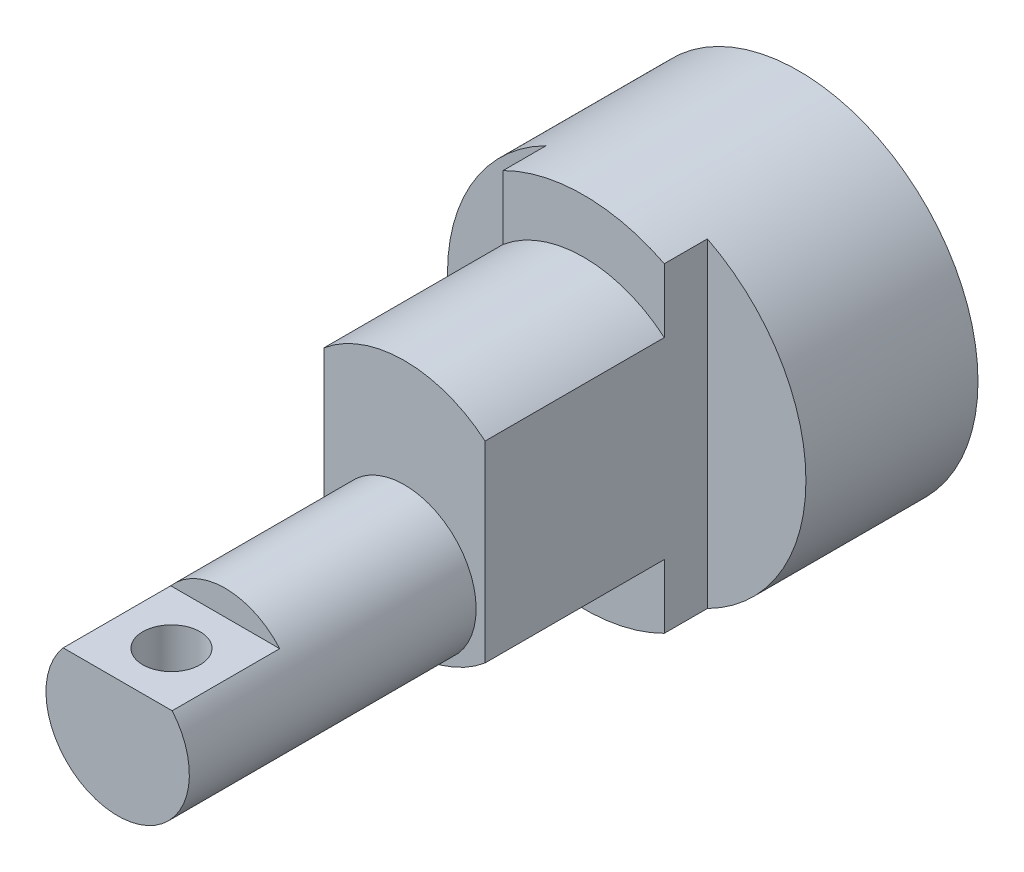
ISO-10303-21;
HEADER;
FILE_DESCRIPTION(('STEP AP214'),'2;1');
FILE_NAME('part.step','',(''),(''),'','','');
FILE_SCHEMA(('AUTOMOTIVE_DESIGN { 1 0 10303 214 1 1 1 1 }'));
ENDSEC;
DATA;
#1=APPLICATION_CONTEXT('core data for automotive mechanical design processes');
#2=APPLICATION_PROTOCOL_DEFINITION('international standard','automotive_design',2000,#1);
#3=PRODUCT_CONTEXT('',#1,'mechanical');
#4=PRODUCT('Part','Part','',(#3));
#5=PRODUCT_RELATED_PRODUCT_CATEGORY('part','',(#4));
#6=PRODUCT_DEFINITION_FORMATION('','',#4);
#7=PRODUCT_DEFINITION_CONTEXT('part definition',#1,'design');
#8=PRODUCT_DEFINITION('design','',#6,#7);
#9=PRODUCT_DEFINITION_SHAPE('','',#8);
#10=(LENGTH_UNIT() NAMED_UNIT(*) SI_UNIT(.MILLI.,.METRE.));
#11=(NAMED_UNIT(*) PLANE_ANGLE_UNIT() SI_UNIT($,.RADIAN.));
#12=(NAMED_UNIT(*) SI_UNIT($,.STERADIAN.) SOLID_ANGLE_UNIT());
#13=UNCERTAINTY_MEASURE_WITH_UNIT(LENGTH_MEASURE(1.E-05),#10,'distance_accuracy_value','');
#14=(GEOMETRIC_REPRESENTATION_CONTEXT(3) GLOBAL_UNCERTAINTY_ASSIGNED_CONTEXT((#13)) GLOBAL_UNIT_ASSIGNED_CONTEXT((#10,
#11,#12)) REPRESENTATION_CONTEXT('',''));
#15=CARTESIAN_POINT('',(0.,0.,0.));
#16=DIRECTION('',(0.,0.,1.));
#17=DIRECTION('',(1.,0.,0.));
#18=AXIS2_PLACEMENT_3D('',#15,#16,#17);
#19=CARTESIAN_POINT('',(0.,0.,60.));
#20=DIRECTION('',(0.,0.,1.));
#21=DIRECTION('',(1.,0.,0.));
#22=AXIS2_PLACEMENT_3D('',#19,#20,#21);
#23=PLANE('',#22);
#24=CARTESIAN_POINT('',(0.,0.,60.));
#25=DIRECTION('',(0.,0.,1.));
#26=DIRECTION('',(1.,0.,0.));
#27=AXIS2_PLACEMENT_3D('',#24,#25,#26);
#28=CIRCLE('',#27,50.);
#29=CARTESIAN_POINT('',(22.5,44.6514277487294,60.));
#30=VERTEX_POINT('',#29);
#31=CARTESIAN_POINT('',(-22.5,44.6514277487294,60.));
#32=VERTEX_POINT('',#31);
#33=EDGE_CURVE('E219',#30,#32,#28,.T.);
#34=ORIENTED_EDGE('',*,*,#33,.T.);
#35=DIRECTION('',(0.,-1.,0.));
#36=VECTOR('',#35,1.);
#37=CARTESIAN_POINT('',(-22.5,0.,60.));
#38=LINE('',#37,#36);
#39=CARTESIAN_POINT('',(-22.5,26.809513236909,60.));
#40=VERTEX_POINT('',#39);
#41=EDGE_CURVE('E134',#32,#40,#38,.T.);
#42=ORIENTED_EDGE('',*,*,#41,.T.);
#43=CARTESIAN_POINT('',(0.,0.,60.));
#44=DIRECTION('',(0.,0.,1.));
#45=DIRECTION('',(1.,0.,0.));
#46=AXIS2_PLACEMENT_3D('',#43,#44,#45);
#47=CIRCLE('',#46,35.);
#48=CARTESIAN_POINT('',(22.5,26.809513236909,60.));
#49=VERTEX_POINT('',#48);
#50=EDGE_CURVE('E240',#49,#40,#47,.T.);
#51=ORIENTED_EDGE('',*,*,#50,.F.);
#52=DIRECTION('',(0.,1.,0.));
#53=VECTOR('',#52,1.);
#54=CARTESIAN_POINT('',(22.5,0.,60.));
#55=LINE('',#54,#53);
#56=EDGE_CURVE('E150',#49,#30,#55,.T.);
#57=ORIENTED_EDGE('',*,*,#56,.T.);
#58=EDGE_LOOP('',(#34,#42,#51,#57));
#59=FACE_BOUND('',#58,.T.);
#60=ADVANCED_FACE('F31',(#59),#23,.T.);
#61=CARTESIAN_POINT('',(-22.5,-26.809513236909,60.));
#62=VERTEX_POINT('',#61);
#63=CARTESIAN_POINT('',(22.5,-26.809513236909,60.));
#64=VERTEX_POINT('',#63);
#65=EDGE_CURVE('E244',#62,#64,#47,.T.);
#66=ORIENTED_EDGE('',*,*,#65,.F.);
#67=CARTESIAN_POINT('',(-22.5,-44.6514277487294,60.));
#68=VERTEX_POINT('',#67);
#69=EDGE_CURVE('E132',#62,#68,#38,.T.);
#70=ORIENTED_EDGE('',*,*,#69,.T.);
#71=CARTESIAN_POINT('',(22.5,-44.6514277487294,60.));
#72=VERTEX_POINT('',#71);
#73=EDGE_CURVE('E125',#68,#72,#28,.T.);
#74=ORIENTED_EDGE('',*,*,#73,.T.);
#75=EDGE_CURVE('E153',#72,#64,#55,.T.);
#76=ORIENTED_EDGE('',*,*,#75,.T.);
#77=EDGE_LOOP('',(#66,#70,#74,#76));
#78=FACE_BOUND('',#77,.T.);
#79=ADVANCED_FACE('F195',(#78),#23,.T.);
#80=CARTESIAN_POINT('',(0.,0.,60.));
#81=DIRECTION('',(0.,0.,-1.));
#82=DIRECTION('',(-1.,0.,0.));
#83=AXIS2_PLACEMENT_3D('',#80,#81,#82);
#84=CYLINDRICAL_SURFACE('',#83,50.);
#85=CARTESIAN_POINT('',(0.,0.,0.));
#86=DIRECTION('',(0.,0.,1.));
#87=DIRECTION('',(1.,0.,0.));
#88=AXIS2_PLACEMENT_3D('',#85,#86,#87);
#89=CIRCLE('',#88,50.);
#90=CARTESIAN_POINT('',(50.,0.,0.));
#91=VERTEX_POINT('',#90);
#92=EDGE_CURVE('E215',#91,#91,#89,.T.);
#93=ORIENTED_EDGE('',*,*,#92,.T.);
#94=EDGE_LOOP('',(#93));
#95=FACE_BOUND('',#94,.T.);
#96=DIRECTION('',(0.,0.,-1.));
#97=VECTOR('',#96,1.);
#98=CARTESIAN_POINT('',(-22.5,44.6514277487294,190.));
#99=LINE('',#98,#97);
#100=CARTESIAN_POINT('',(-22.5,44.6514277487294,48.));
#101=VERTEX_POINT('',#100);
#102=EDGE_CURVE('E115',#32,#101,#99,.T.);
#103=ORIENTED_EDGE('',*,*,#102,.F.);
#104=ORIENTED_EDGE('',*,*,#33,.F.);
#105=DIRECTION('',(0.,0.,-1.));
#106=VECTOR('',#105,1.);
#107=CARTESIAN_POINT('',(22.5,44.6514277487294,190.));
#108=LINE('',#107,#106);
#109=CARTESIAN_POINT('',(22.5,44.6514277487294,48.));
#110=VERTEX_POINT('',#109);
#111=EDGE_CURVE('E143',#30,#110,#108,.T.);
#112=ORIENTED_EDGE('',*,*,#111,.T.);
#113=CARTESIAN_POINT('',(0.,0.,48.));
#114=DIRECTION('',(0.,0.,1.));
#115=DIRECTION('',(1.,0.,0.));
#116=AXIS2_PLACEMENT_3D('',#113,#114,#115);
#117=CIRCLE('',#116,50.);
#118=CARTESIAN_POINT('',(22.5,-44.6514277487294,48.));
#119=VERTEX_POINT('',#118);
#120=EDGE_CURVE('E135',#119,#110,#117,.T.);
#121=ORIENTED_EDGE('',*,*,#120,.F.);
#122=DIRECTION('',(0.,0.,-1.));
#123=VECTOR('',#122,1.);
#124=CARTESIAN_POINT('',(22.5,-44.6514277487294,190.));
#125=LINE('',#124,#123);
#126=EDGE_CURVE('E141',#72,#119,#125,.T.);
#127=ORIENTED_EDGE('',*,*,#126,.F.);
#128=ORIENTED_EDGE('',*,*,#73,.F.);
#129=DIRECTION('',(0.,0.,-1.));
#130=VECTOR('',#129,1.);
#131=CARTESIAN_POINT('',(-22.5,-44.6514277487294,190.));
#132=LINE('',#131,#130);
#133=CARTESIAN_POINT('',(-22.5,-44.6514277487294,48.));
#134=VERTEX_POINT('',#133);
#135=EDGE_CURVE('E112',#68,#134,#132,.T.);
#136=ORIENTED_EDGE('',*,*,#135,.T.);
#137=CARTESIAN_POINT('',(0.,0.,48.));
#138=DIRECTION('',(0.,0.,1.));
#139=DIRECTION('',(1.,0.,0.));
#140=AXIS2_PLACEMENT_3D('',#137,#138,#139);
#141=CIRCLE('',#140,50.);
#142=EDGE_CURVE('E118',#101,#134,#141,.T.);
#143=ORIENTED_EDGE('',*,*,#142,.F.);
#144=EDGE_LOOP('',(#103,#104,#112,#121,#127,#128,#136,#143));
#145=FACE_BOUND('',#144,.T.);
#146=ADVANCED_FACE('F33',(#95,#145),#84,.T.);
#147=CARTESIAN_POINT('',(0.,0.,110.));
#148=DIRECTION('',(0.,0.,-1.));
#149=DIRECTION('',(-1.,0.,0.));
#150=AXIS2_PLACEMENT_3D('',#147,#148,#149);
#151=CYLINDRICAL_SURFACE('',#150,35.);
#152=DIRECTION('',(0.,0.,-1.));
#153=VECTOR('',#152,1.);
#154=CARTESIAN_POINT('',(-22.5,26.809513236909,110.));
#155=LINE('',#154,#153);
#156=CARTESIAN_POINT('',(-22.5,26.809513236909,110.));
#157=VERTEX_POINT('',#156);
#158=EDGE_CURVE('E127',#157,#40,#155,.T.);
#159=ORIENTED_EDGE('',*,*,#158,.F.);
#160=CARTESIAN_POINT('',(0.,0.,110.));
#161=DIRECTION('',(0.,0.,1.));
#162=DIRECTION('',(1.,0.,0.));
#163=AXIS2_PLACEMENT_3D('',#160,#161,#162);
#164=CIRCLE('',#163,35.);
#165=CARTESIAN_POINT('',(22.5,26.809513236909,110.));
#166=VERTEX_POINT('',#165);
#167=EDGE_CURVE('E222',#166,#157,#164,.T.);
#168=ORIENTED_EDGE('',*,*,#167,.F.);
#169=DIRECTION('',(0.,0.,-1.));
#170=VECTOR('',#169,1.);
#171=CARTESIAN_POINT('',(22.5,26.809513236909,110.));
#172=LINE('',#171,#170);
#173=EDGE_CURVE('E53',#49,#166,#172,.F.);
#174=ORIENTED_EDGE('',*,*,#173,.F.);
#175=ORIENTED_EDGE('',*,*,#50,.T.);
#176=EDGE_LOOP('',(#159,#168,#174,#175));
#177=FACE_BOUND('',#176,.T.);
#178=ADVANCED_FACE('F204',(#177),#151,.T.);
#179=DIRECTION('',(0.,0.,-1.));
#180=VECTOR('',#179,1.);
#181=CARTESIAN_POINT('',(-22.5,-26.809513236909,110.));
#182=LINE('',#181,#180);
#183=CARTESIAN_POINT('',(-22.5,-26.809513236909,110.));
#184=VERTEX_POINT('',#183);
#185=EDGE_CURVE('E46',#62,#184,#182,.F.);
#186=ORIENTED_EDGE('',*,*,#185,.F.);
#187=ORIENTED_EDGE('',*,*,#65,.T.);
#188=DIRECTION('',(0.,0.,-1.));
#189=VECTOR('',#188,1.);
#190=CARTESIAN_POINT('',(22.5,-26.809513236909,110.));
#191=LINE('',#190,#189);
#192=CARTESIAN_POINT('',(22.5,-26.809513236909,110.));
#193=VERTEX_POINT('',#192);
#194=EDGE_CURVE('E147',#193,#64,#191,.T.);
#195=ORIENTED_EDGE('',*,*,#194,.F.);
#196=CARTESIAN_POINT('',(0.,-35.,110.));
#197=VERTEX_POINT('',#196);
#198=EDGE_CURVE('E217',#197,#193,#164,.T.);
#199=ORIENTED_EDGE('',*,*,#198,.F.);
#200=EDGE_CURVE('E224',#184,#197,#164,.T.);
#201=ORIENTED_EDGE('',*,*,#200,.F.);
#202=EDGE_LOOP('',(#186,#187,#195,#199,#201));
#203=FACE_BOUND('',#202,.T.);
#204=ADVANCED_FACE('F211',(#203),#151,.T.);
#205=CARTESIAN_POINT('',(0.,0.,110.));
#206=DIRECTION('',(0.,0.,1.));
#207=DIRECTION('',(1.,0.,0.));
#208=AXIS2_PLACEMENT_3D('',#205,#206,#207);
#209=PLANE('',#208);
#210=ORIENTED_EDGE('',*,*,#167,.T.);
#211=DIRECTION('',(0.,-1.,0.));
#212=VECTOR('',#211,1.);
#213=CARTESIAN_POINT('',(-22.5,0.,110.));
#214=LINE('',#213,#212);
#215=EDGE_CURVE('E11',#157,#184,#214,.T.);
#216=ORIENTED_EDGE('',*,*,#215,.T.);
#217=ORIENTED_EDGE('',*,*,#200,.T.);
#218=CARTESIAN_POINT('',(0.,-15.,110.));
#219=DIRECTION('',(0.,0.,1.));
#220=DIRECTION('',(1.,0.,0.));
#221=AXIS2_PLACEMENT_3D('',#218,#219,#220);
#222=CIRCLE('',#221,20.);
#223=EDGE_CURVE('E242',#197,#197,#222,.T.);
#224=ORIENTED_EDGE('',*,*,#223,.F.);
#225=ORIENTED_EDGE('',*,*,#198,.T.);
#226=DIRECTION('',(0.,1.,0.));
#227=VECTOR('',#226,1.);
#228=CARTESIAN_POINT('',(22.5,0.,110.));
#229=LINE('',#228,#227);
#230=EDGE_CURVE('E39',#193,#166,#229,.T.);
#231=ORIENTED_EDGE('',*,*,#230,.T.);
#232=EDGE_LOOP('',(#210,#216,#217,#224,#225,#231));
#233=FACE_BOUND('',#232,.T.);
#234=ADVANCED_FACE('F206',(#233),#209,.T.);
#235=CARTESIAN_POINT('',(0.,0.,0.));
#236=DIRECTION('',(0.,0.,1.));
#237=DIRECTION('',(1.,0.,0.));
#238=AXIS2_PLACEMENT_3D('',#235,#236,#237);
#239=PLANE('',#238);
#240=ORIENTED_EDGE('',*,*,#92,.F.);
#241=EDGE_LOOP('',(#240));
#242=FACE_BOUND('',#241,.T.);
#243=ADVANCED_FACE('F191',(#242),#239,.F.);
#244=CARTESIAN_POINT('',(0.,-15.,190.));
#245=DIRECTION('',(0.,0.,-1.));
#246=DIRECTION('',(-1.,0.,0.));
#247=AXIS2_PLACEMENT_3D('',#244,#245,#246);
#248=CYLINDRICAL_SURFACE('',#247,20.);
#249=CARTESIAN_POINT('',(0.,-35.,183.));
#250=CARTESIAN_POINT('',(0.215084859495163,-34.9999990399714,182.999998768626));
#251=CARTESIAN_POINT('',(0.430252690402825,-34.9965207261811,182.991314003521));
#252=CARTESIAN_POINT('',(0.859066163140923,-34.9826945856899,182.956653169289));
#253=CARTESIAN_POINT('',(1.07271069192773,-34.9723421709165,182.930665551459));
#254=CARTESIAN_POINT('',(1.49730331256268,-34.9450103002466,182.861580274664));
#255=CARTESIAN_POINT('',(1.70824399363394,-34.928015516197,182.818443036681));
#256=CARTESIAN_POINT('',(2.12541850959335,-34.8878485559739,182.715488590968));
#257=CARTESIAN_POINT('',(2.3316520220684,-34.864675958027,182.655670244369));
#258=CARTESIAN_POINT('',(2.7373286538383,-34.8128420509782,182.520147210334));
#259=CARTESIAN_POINT('',(2.93679233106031,-34.7841995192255,182.444496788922));
#260=CARTESIAN_POINT('',(3.32841850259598,-34.722092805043,182.277837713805));
#261=CARTESIAN_POINT('',(3.5205807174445,-34.6886284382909,182.186828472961));
#262=CARTESIAN_POINT('',(3.89636668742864,-34.6177182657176,181.990226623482));
#263=CARTESIAN_POINT('',(4.0799955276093,-34.5802748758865,181.884642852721));
#264=CARTESIAN_POINT('',(4.43790440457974,-34.5022708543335,181.659558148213));
#265=CARTESIAN_POINT('',(4.61218102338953,-34.4617090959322,181.540052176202));
#266=CARTESIAN_POINT('',(4.95765252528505,-34.3766526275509,181.282520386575));
#267=CARTESIAN_POINT('',(5.12839697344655,-34.3320639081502,181.143921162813));
#268=CARTESIAN_POINT('',(5.45773322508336,-34.2416816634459,180.853322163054));
#269=CARTESIAN_POINT('',(5.616324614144,-34.1958880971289,180.701321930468));
#270=CARTESIAN_POINT('',(5.92057321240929,-34.1042423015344,180.384704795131));
#271=CARTESIAN_POINT('',(6.06622210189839,-34.0583900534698,180.220079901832));
#272=CARTESIAN_POINT('',(6.34357963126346,-33.9678748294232,179.87926764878));
#273=CARTESIAN_POINT('',(6.4752929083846,-33.9232114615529,179.703084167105));
#274=CARTESIAN_POINT('',(6.7296133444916,-33.8343107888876,179.331878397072));
#275=CARTESIAN_POINT('',(6.85154351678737,-33.7901832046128,179.13636506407));
#276=CARTESIAN_POINT('',(7.07835580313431,-33.705921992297,178.73496931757));
#277=CARTESIAN_POINT('',(7.18324492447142,-33.6657867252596,178.529091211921));
#278=CARTESIAN_POINT('',(7.37511081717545,-33.5908137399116,178.108248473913));
#279=CARTESIAN_POINT('',(7.4620902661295,-33.5559752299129,177.893285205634));
#280=CARTESIAN_POINT('',(7.61728962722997,-33.4928075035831,177.455761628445));
#281=CARTESIAN_POINT('',(7.68551081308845,-33.4644778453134,177.233201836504));
#282=CARTESIAN_POINT('',(7.79978805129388,-33.416486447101,176.792419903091));
#283=CARTESIAN_POINT('',(7.84670853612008,-33.3964900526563,176.574458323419));
#284=CARTESIAN_POINT('',(7.92224162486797,-33.3640895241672,176.134824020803));
#285=CARTESIAN_POINT('',(7.95085475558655,-33.3516851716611,175.913151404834));
#286=CARTESIAN_POINT('',(7.98942376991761,-33.3349271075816,175.467978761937));
#287=CARTESIAN_POINT('',(7.99938754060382,-33.3305699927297,175.244479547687));
#288=CARTESIAN_POINT('',(8.00055757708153,-33.3300595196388,174.797427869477));
#289=CARTESIAN_POINT('',(7.99176471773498,-33.3339057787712,174.573875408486));
#290=CARTESIAN_POINT('',(7.95680250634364,-33.3491040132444,174.144155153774));
#291=CARTESIAN_POINT('',(7.93189049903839,-33.3599126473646,173.937864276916));
#292=CARTESIAN_POINT('',(7.86618688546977,-33.3881587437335,173.528215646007));
#293=CARTESIAN_POINT('',(7.82538978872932,-33.4055984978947,173.324858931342));
#294=CARTESIAN_POINT('',(7.72832801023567,-33.4465637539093,172.922560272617));
#295=CARTESIAN_POINT('',(7.67206718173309,-33.4700877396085,172.723617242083));
#296=CARTESIAN_POINT('',(7.54455726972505,-33.5225377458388,172.331249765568));
#297=CARTESIAN_POINT('',(7.4733024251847,-33.5514658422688,172.13782747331));
#298=CARTESIAN_POINT('',(7.31482768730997,-33.6145295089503,171.753881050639));
#299=CARTESIAN_POINT('',(7.22731692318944,-33.648757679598,171.563492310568));
#300=CARTESIAN_POINT('',(7.03795125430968,-33.7210446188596,171.190672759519));
#301=CARTESIAN_POINT('',(6.93609149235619,-33.7591046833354,171.008244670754));
#302=CARTESIAN_POINT('',(6.71872095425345,-33.8380507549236,170.652325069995));
#303=CARTESIAN_POINT('',(6.60320835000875,-33.8789371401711,170.478834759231));
#304=CARTESIAN_POINT('',(6.35923627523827,-33.9625087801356,170.141664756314));
#305=CARTESIAN_POINT('',(6.23077613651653,-34.0051941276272,169.97798557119));
#306=CARTESIAN_POINT('',(5.95116932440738,-34.0946788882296,169.648950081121));
#307=CARTESIAN_POINT('',(5.79903588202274,-34.1415406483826,169.484447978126));
#308=CARTESIAN_POINT('',(5.48150551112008,-34.2348764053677,169.168773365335));
#309=CARTESIAN_POINT('',(5.31611250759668,-34.2813505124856,169.01759693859));
#310=CARTESIAN_POINT('',(4.97286450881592,-34.3727172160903,168.729364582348));
#311=CARTESIAN_POINT('',(4.79500239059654,-34.4176088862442,168.592316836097));
#312=CARTESIAN_POINT('',(4.42799503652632,-34.5045739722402,168.333421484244));
#313=CARTESIAN_POINT('',(4.23885435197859,-34.5466485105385,168.211567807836));
#314=CARTESIAN_POINT('',(3.84640227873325,-34.6276879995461,167.981598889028));
#315=CARTESIAN_POINT('',(3.64288128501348,-34.6665725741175,167.873812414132));
#316=CARTESIAN_POINT('',(3.22662197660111,-34.7391367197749,167.675930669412));
#317=CARTESIAN_POINT('',(3.01388765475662,-34.7728185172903,167.585827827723));
#318=CARTESIAN_POINT('',(2.58066910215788,-34.8340108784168,167.424144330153));
#319=CARTESIAN_POINT('',(2.36018631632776,-34.8615225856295,167.352560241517));
#320=CARTESIAN_POINT('',(1.913130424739,-34.9095569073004,167.228660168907));
#321=CARTESIAN_POINT('',(1.68655774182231,-34.9300800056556,167.176342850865));
#322=CARTESIAN_POINT('',(1.24272594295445,-34.9625193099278,167.094083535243));
#323=CARTESIAN_POINT('',(1.02570985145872,-34.974873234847,167.062999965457));
#324=CARTESIAN_POINT('',(0.589574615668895,-34.9924991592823,167.018744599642));
#325=CARTESIAN_POINT('',(0.370455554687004,-34.9977714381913,167.005572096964));
#326=CARTESIAN_POINT('',(-0.0681278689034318,-35.0010860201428,166.997284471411));
#327=CARTESIAN_POINT('',(-0.287592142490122,-34.9991299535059,167.002165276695));
#328=CARTESIAN_POINT('',(-0.725194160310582,-34.9880462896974,167.02992114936));
#329=CARTESIAN_POINT('',(-0.943331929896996,-34.978918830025,167.052795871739));
#330=CARTESIAN_POINT('',(-1.36679772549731,-34.9543179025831,167.114851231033));
#331=CARTESIAN_POINT('',(-1.57225908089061,-34.9391499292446,167.153248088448));
#332=CARTESIAN_POINT('',(-1.97912323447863,-34.9028842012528,167.245864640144));
#333=CARTESIAN_POINT('',(-2.18052458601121,-34.8817843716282,167.300089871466));
#334=CARTESIAN_POINT('',(-2.57783869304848,-34.834181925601,167.423851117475));
#335=CARTESIAN_POINT('',(-2.7737530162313,-34.8076808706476,167.493382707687));
#336=CARTESIAN_POINT('',(-3.15904550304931,-34.7498961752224,167.647212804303));
#337=CARTESIAN_POINT('',(-3.34842114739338,-34.7186107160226,167.731516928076));
#338=CARTESIAN_POINT('',(-3.72510207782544,-34.6509879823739,167.916991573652));
#339=CARTESIAN_POINT('',(-3.9121720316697,-34.6145266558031,168.018594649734));
#340=CARTESIAN_POINT('',(-4.27717789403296,-34.5381813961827,168.23605894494));
#341=CARTESIAN_POINT('',(-4.45511064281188,-34.4982962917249,168.351925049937));
#342=CARTESIAN_POINT('',(-4.8008662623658,-34.4160569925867,168.597140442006));
#343=CARTESIAN_POINT('',(-4.96868742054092,-34.3737023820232,168.726492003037));
#344=CARTESIAN_POINT('',(-5.29333521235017,-34.2875300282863,168.997886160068));
#345=CARTESIAN_POINT('',(-5.45016136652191,-34.2437122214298,169.139929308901));
#346=CARTESIAN_POINT('',(-5.7620262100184,-34.1527323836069,169.445735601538));
#347=CARTESIAN_POINT('',(-5.91625778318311,-34.1055411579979,169.610314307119));
#348=CARTESIAN_POINT('',(-6.21033668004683,-34.0119837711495,169.951979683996));
#349=CARTESIAN_POINT('',(-6.35018846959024,-33.9656173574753,170.12906244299));
#350=CARTESIAN_POINT('',(-6.61474406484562,-33.8749762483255,170.494876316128));
#351=CARTESIAN_POINT('',(-6.73943916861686,-33.8307027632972,170.683614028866));
#352=CARTESIAN_POINT('',(-6.97264868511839,-33.7456015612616,171.071469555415));
#353=CARTESIAN_POINT('',(-7.08116989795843,-33.7047723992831,171.270582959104));
#354=CARTESIAN_POINT('',(-7.28224510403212,-33.6274162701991,171.680139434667));
#355=CARTESIAN_POINT('',(-7.37462441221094,-33.5909375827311,171.890677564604));
#356=CARTESIAN_POINT('',(-7.54113952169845,-33.5240187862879,172.31967768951));
#357=CARTESIAN_POINT('',(-7.61528359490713,-33.4935759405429,172.5381360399));
#358=CARTESIAN_POINT('',(-7.74457443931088,-33.4398068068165,172.981377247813));
#359=CARTESIAN_POINT('',(-7.79972849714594,-33.4164777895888,173.206157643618));
#360=CARTESIAN_POINT('',(-7.89042733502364,-33.3778017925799,173.660312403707));
#361=CARTESIAN_POINT('',(-7.92597375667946,-33.3624541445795,173.889686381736));
#362=CARTESIAN_POINT('',(-7.97517553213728,-33.3411350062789,174.334439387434));
#363=CARTESIAN_POINT('',(-7.99022284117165,-33.3345679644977,174.549636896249));
#364=CARTESIAN_POINT('',(-8.00288059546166,-33.3290467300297,174.980637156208));
#365=CARTESIAN_POINT('',(-8.00049191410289,-33.3300921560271,175.196439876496));
#366=CARTESIAN_POINT('',(-7.97830753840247,-33.3397587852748,175.626948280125));
#367=CARTESIAN_POINT('',(-7.95851389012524,-33.3483790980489,175.841654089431));
#368=CARTESIAN_POINT('',(-7.90174628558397,-33.3728973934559,176.268357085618));
#369=CARTESIAN_POINT('',(-7.86477240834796,-33.3887953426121,176.480354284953));
#370=CARTESIAN_POINT('',(-7.77585282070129,-33.4265662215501,176.89172445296));
#371=CARTESIAN_POINT('',(-7.72456216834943,-33.4481759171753,177.091263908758));
#372=CARTESIAN_POINT('',(-7.60696222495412,-33.4969774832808,177.485236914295));
#373=CARTESIAN_POINT('',(-7.54064771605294,-33.524171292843,177.679668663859));
#374=CARTESIAN_POINT('',(-7.3935752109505,-33.583361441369,178.062193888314));
#375=CARTESIAN_POINT('',(-7.31281928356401,-33.6153570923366,178.250288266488));
#376=CARTESIAN_POINT('',(-7.13743281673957,-33.6833052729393,178.619225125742));
#377=CARTESIAN_POINT('',(-7.0427972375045,-33.7192592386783,178.800064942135));
#378=CARTESIAN_POINT('',(-6.83452089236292,-33.7963385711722,179.163613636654));
#379=CARTESIAN_POINT('',(-6.72010371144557,-33.8376419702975,179.345840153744));
#380=CARTESIAN_POINT('',(-6.47725116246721,-33.9225198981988,179.700143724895));
#381=CARTESIAN_POINT('',(-6.34881503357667,-33.966094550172,179.872220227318));
#382=CARTESIAN_POINT('',(-6.07864156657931,-34.0544041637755,180.205394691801));
#383=CARTESIAN_POINT('',(-5.93689885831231,-34.0991395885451,180.366488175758));
#384=CARTESIAN_POINT('',(-5.64098897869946,-34.1886197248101,180.676723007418));
#385=CARTESIAN_POINT('',(-5.48682556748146,-34.2333644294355,180.825867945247));
#386=CARTESIAN_POINT('',(-5.15638784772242,-34.3246713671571,181.120771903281));
#387=CARTESIAN_POINT('',(-4.97932704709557,-34.3711614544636,181.265673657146));
#388=CARTESIAN_POINT('',(-4.61309243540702,-34.4616273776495,181.540008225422));
#389=CARTESIAN_POINT('',(-4.42392269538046,-34.5056040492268,181.669446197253));
#390=CARTESIAN_POINT('',(-4.03442016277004,-34.5898744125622,181.912027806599));
#391=CARTESIAN_POINT('',(-3.83407926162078,-34.6301653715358,182.025159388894));
#392=CARTESIAN_POINT('',(-3.42366728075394,-34.7058882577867,182.234052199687));
#393=CARTESIAN_POINT('',(-3.21359701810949,-34.7413205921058,182.329814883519));
#394=CARTESIAN_POINT('',(-2.78913551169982,-34.8057048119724,182.501477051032));
#395=CARTESIAN_POINT('',(-2.57489607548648,-34.8347644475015,182.577711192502));
#396=CARTESIAN_POINT('',(-2.13999204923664,-34.8863864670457,182.711822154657));
#397=CARTESIAN_POINT('',(-1.91932808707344,-34.9089494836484,182.769700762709));
#398=CARTESIAN_POINT('',(-1.47388638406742,-34.9468668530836,182.866350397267));
#399=CARTESIAN_POINT('',(-1.24912144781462,-34.9622406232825,182.905172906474));
#400=CARTESIAN_POINT('',(-0.796824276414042,-34.9854014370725,182.963478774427));
#401=CARTESIAN_POINT('',(-0.569294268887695,-34.9931942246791,182.982976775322));
#402=CARTESIAN_POINT('',(-0.284520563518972,-34.9980572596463,182.995141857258));
#403=CARTESIAN_POINT('',(-0.22763576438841,-34.9987854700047,182.996963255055));
#404=CARTESIAN_POINT('',(-0.113835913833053,-34.9997569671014,182.999392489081));
#405=CARTESIAN_POINT('',(-0.056920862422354,-35.0000002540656,183.000000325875));
#406=CARTESIAN_POINT('',(0.,-35.,183.));
#407=B_SPLINE_CURVE_WITH_KNOTS('',3,(#249,#250,#251,#252,#253,#254,#255,#256,#257,#258,#259,
#260,#261,#262,#263,#264,#265,#266,#267,#268,#269,#270,#271,#272,#273,#274,#275,#276,#277,#278,
#279,#280,#281,#282,#283,#284,#285,#286,#287,#288,#289,#290,#291,#292,#293,#294,#295,#296,#297,
#298,#299,#300,#301,#302,#303,#304,#305,#306,#307,#308,#309,#310,#311,#312,#313,#314,#315,#316,
#317,#318,#319,#320,#321,#322,#323,#324,#325,#326,#327,#328,#329,#330,#331,#332,#333,#334,#335,
#336,#337,#338,#339,#340,#341,#342,#343,#344,#345,#346,#347,#348,#349,#350,#351,#352,#353,#354,
#355,#356,#357,#358,#359,#360,#361,#362,#363,#364,#365,#366,#367,#368,#369,#370,#371,#372,#373,
#374,#375,#376,#377,#378,#379,#380,#381,#382,#383,#384,#385,#386,#387,#388,#389,#390,#391,#392,
#393,#394,#395,#396,#397,#398,#399,#400,#401,#402,#403,#404,#405,#406),.UNSPECIFIED.,.T.,.F.,(4,
2,2,2,2,2,2,2,2,2,2,2,2,2,2,2,2,2,2,2,2,2,2,2,2,2,2,2,2,2,2,2,2,2,2,2,2,2,2,2,2,2,2,2,2,2,2,2,2,
2,2,2,2,2,2,2,2,2,2,2,2,2,2,2,2,2,2,2,2,2,2,2,2,2,2,2,2,2,4),(0.,0.645196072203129,
1.29082320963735,1.93794909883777,2.58511918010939,3.23010632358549,3.87511812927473,
4.51974050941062,5.16459689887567,5.83702768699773,6.50948139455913,7.18236428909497,
7.85502256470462,8.55796624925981,9.26062014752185,9.9631689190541,10.6656699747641,
11.3363324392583,12.00697560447,12.6773350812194,13.3476632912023,13.9711439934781,
14.5948403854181,15.2183815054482,15.842162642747,16.4784228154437,17.1148988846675,
17.7514602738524,18.3880545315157,19.074013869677,19.7597708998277,20.4459229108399,
21.1317998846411,21.8315877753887,22.5310753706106,23.2304332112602,23.9297426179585,
24.5876396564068,25.2455107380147,25.9032334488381,26.5609435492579,27.1889245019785,
27.8171253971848,28.4451449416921,29.0734038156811,29.7206402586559,30.3680990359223,
31.0156671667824,31.6632635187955,32.3537739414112,33.0440692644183,33.734759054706,
34.4251576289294,35.1226183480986,35.8197620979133,36.5166380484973,37.2134556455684,
37.8600994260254,38.5067108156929,39.1532462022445,39.7997786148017,40.4205569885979,
41.0415512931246,41.6624567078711,42.2835881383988,42.9401687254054,43.596784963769,
44.2536673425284,44.9103516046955,45.6099230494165,46.3092605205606,47.0091123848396,
47.7089055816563,48.3957541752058,49.0825358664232,49.7674517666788,50.4518483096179,
50.6225954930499,50.7933425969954),.UNSPECIFIED.);
#408=CARTESIAN_POINT('',(0.,-35.,183.));
#409=VERTEX_POINT('',#408);
#410=EDGE_CURVE('E157',#409,#409,#407,.T.);
#411=ORIENTED_EDGE('',*,*,#410,.T.);
#412=EDGE_LOOP('',(#411));
#413=FACE_BOUND('',#412,.T.);
#414=CARTESIAN_POINT('',(0.,-15.,190.));
#415=DIRECTION('',(0.,0.,1.));
#416=DIRECTION('',(1.,0.,0.));
#417=AXIS2_PLACEMENT_3D('',#414,#415,#416);
#418=CIRCLE('',#417,20.);
#419=CARTESIAN_POINT('',(-15.1986841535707,-2.,190.));
#420=VERTEX_POINT('',#419);
#421=CARTESIAN_POINT('',(15.1986841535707,-2.,190.));
#422=VERTEX_POINT('',#421);
#423=EDGE_CURVE('E245',#420,#422,#418,.T.);
#424=ORIENTED_EDGE('',*,*,#423,.F.);
#425=DIRECTION('',(0.,0.,-1.));
#426=VECTOR('',#425,1.);
#427=CARTESIAN_POINT('',(-15.1986841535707,-2.,190.));
#428=LINE('',#427,#426);
#429=CARTESIAN_POINT('',(-15.1986841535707,-2.,160.));
#430=VERTEX_POINT('',#429);
#431=EDGE_CURVE('E251',#420,#430,#428,.T.);
#432=ORIENTED_EDGE('',*,*,#431,.T.);
#433=CARTESIAN_POINT('',(0.,-15.,160.));
#434=DIRECTION('',(0.,0.,-1.));
#435=DIRECTION('',(-1.,0.,0.));
#436=AXIS2_PLACEMENT_3D('',#433,#434,#435);
#437=CIRCLE('',#436,20.);
#438=CARTESIAN_POINT('',(15.1986841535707,-2.,160.));
#439=VERTEX_POINT('',#438);
#440=EDGE_CURVE('E229',#430,#439,#437,.T.);
#441=ORIENTED_EDGE('',*,*,#440,.T.);
#442=DIRECTION('',(0.,0.,-1.));
#443=VECTOR('',#442,1.);
#444=CARTESIAN_POINT('',(15.1986841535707,-2.,190.));
#445=LINE('',#444,#443);
#446=EDGE_CURVE('E254',#439,#422,#445,.F.);
#447=ORIENTED_EDGE('',*,*,#446,.T.);
#448=EDGE_LOOP('',(#424,#432,#441,#447));
#449=FACE_BOUND('',#448,.T.);
#450=ORIENTED_EDGE('',*,*,#223,.T.);
#451=EDGE_LOOP('',(#450));
#452=FACE_BOUND('',#451,.T.);
#453=ADVANCED_FACE('F166',(#413,#449,#452),#248,.T.);
#454=CARTESIAN_POINT('',(0.,-15.,190.));
#455=DIRECTION('',(0.,0.,1.));
#456=DIRECTION('',(1.,0.,0.));
#457=AXIS2_PLACEMENT_3D('',#454,#455,#456);
#458=PLANE('',#457);
#459=DIRECTION('',(1.,0.,0.));
#460=VECTOR('',#459,1.);
#461=CARTESIAN_POINT('',(0.,-2.,190.));
#462=LINE('',#461,#460);
#463=EDGE_CURVE('E227',#420,#422,#462,.T.);
#464=ORIENTED_EDGE('',*,*,#463,.F.);
#465=ORIENTED_EDGE('',*,*,#423,.T.);
#466=EDGE_LOOP('',(#464,#465));
#467=FACE_BOUND('',#466,.T.);
#468=ADVANCED_FACE('F184',(#467),#458,.T.);
#469=CARTESIAN_POINT('',(-20.,-2.,160.));
#470=DIRECTION('',(0.,0.,-1.));
#471=DIRECTION('',(-1.,0.,0.));
#472=AXIS2_PLACEMENT_3D('',#469,#470,#471);
#473=PLANE('',#472);
#474=DIRECTION('',(-1.,0.,0.));
#475=VECTOR('',#474,1.);
#476=CARTESIAN_POINT('',(-20.,-2.,160.));
#477=LINE('',#476,#475);
#478=EDGE_CURVE('E164',#439,#430,#477,.T.);
#479=ORIENTED_EDGE('',*,*,#478,.F.);
#480=ORIENTED_EDGE('',*,*,#440,.F.);
#481=EDGE_LOOP('',(#479,#480));
#482=FACE_BOUND('',#481,.T.);
#483=ADVANCED_FACE('F181',(#482),#473,.F.);
#484=CARTESIAN_POINT('',(-20.,-2.,190.));
#485=DIRECTION('',(0.,-1.,0.));
#486=DIRECTION('',(0.,0.,-1.));
#487=AXIS2_PLACEMENT_3D('',#484,#485,#486);
#488=PLANE('',#487);
#489=CARTESIAN_POINT('',(0.,-2.,175.));
#490=DIRECTION('',(0.,1.,0.));
#491=DIRECTION('',(0.,0.,1.));
#492=AXIS2_PLACEMENT_3D('',#489,#490,#491);
#493=CIRCLE('',#492,8.);
#494=CARTESIAN_POINT('',(0.,-2.,183.));
#495=VERTEX_POINT('',#494);
#496=EDGE_CURVE('E154',#495,#495,#493,.T.);
#497=ORIENTED_EDGE('',*,*,#496,.F.);
#498=EDGE_LOOP('',(#497));
#499=FACE_BOUND('',#498,.T.);
#500=ORIENTED_EDGE('',*,*,#463,.T.);
#501=ORIENTED_EDGE('',*,*,#446,.F.);
#502=ORIENTED_EDGE('',*,*,#478,.T.);
#503=ORIENTED_EDGE('',*,*,#431,.F.);
#504=EDGE_LOOP('',(#500,#501,#502,#503));
#505=FACE_BOUND('',#504,.T.);
#506=ADVANCED_FACE('F176',(#499,#505),#488,.F.);
#507=CARTESIAN_POINT('',(0.,-50.,175.));
#508=DIRECTION('',(0.,1.,0.));
#509=DIRECTION('',(0.,0.,1.));
#510=AXIS2_PLACEMENT_3D('',#507,#508,#509);
#511=CYLINDRICAL_SURFACE('',#510,8.);
#512=ORIENTED_EDGE('',*,*,#496,.T.);
#513=EDGE_LOOP('',(#512));
#514=FACE_BOUND('',#513,.T.);
#515=ORIENTED_EDGE('',*,*,#410,.F.);
#516=EDGE_LOOP('',(#515));
#517=FACE_BOUND('',#516,.T.);
#518=ADVANCED_FACE('F170',(#514,#517),#511,.F.);
#519=CARTESIAN_POINT('',(22.5,-44.6514277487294,190.));
#520=DIRECTION('',(1.,0.,0.));
#521=DIRECTION('',(0.,0.,-1.));
#522=AXIS2_PLACEMENT_3D('',#519,#520,#521);
#523=PLANE('',#522);
#524=ORIENTED_EDGE('',*,*,#126,.T.);
#525=DIRECTION('',(0.,-1.,0.));
#526=VECTOR('',#525,1.);
#527=CARTESIAN_POINT('',(22.5,-44.6514277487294,48.));
#528=LINE('',#527,#526);
#529=EDGE_CURVE('E138',#110,#119,#528,.T.);
#530=ORIENTED_EDGE('',*,*,#529,.F.);
#531=ORIENTED_EDGE('',*,*,#111,.F.);
#532=ORIENTED_EDGE('',*,*,#56,.F.);
#533=ORIENTED_EDGE('',*,*,#173,.T.);
#534=ORIENTED_EDGE('',*,*,#230,.F.);
#535=ORIENTED_EDGE('',*,*,#194,.T.);
#536=ORIENTED_EDGE('',*,*,#75,.F.);
#537=EDGE_LOOP('',(#524,#530,#531,#532,#533,#534,#535,#536));
#538=FACE_BOUND('',#537,.T.);
#539=ADVANCED_FACE('F175',(#538),#523,.T.);
#540=CARTESIAN_POINT('',(0.,0.,48.));
#541=DIRECTION('',(0.,0.,1.));
#542=DIRECTION('',(1.,0.,0.));
#543=AXIS2_PLACEMENT_3D('',#540,#541,#542);
#544=PLANE('',#543);
#545=ORIENTED_EDGE('',*,*,#120,.T.);
#546=ORIENTED_EDGE('',*,*,#529,.T.);
#547=EDGE_LOOP('',(#545,#546));
#548=FACE_BOUND('',#547,.T.);
#549=ADVANCED_FACE('F267',(#548),#544,.T.);
#550=CARTESIAN_POINT('',(-22.5,44.6514277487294,190.));
#551=DIRECTION('',(-1.,0.,0.));
#552=DIRECTION('',(0.,0.,1.));
#553=AXIS2_PLACEMENT_3D('',#550,#551,#552);
#554=PLANE('',#553);
#555=ORIENTED_EDGE('',*,*,#102,.T.);
#556=DIRECTION('',(0.,1.,0.));
#557=VECTOR('',#556,1.);
#558=CARTESIAN_POINT('',(-22.5,44.6514277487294,48.));
#559=LINE('',#558,#557);
#560=EDGE_CURVE('E108',#134,#101,#559,.T.);
#561=ORIENTED_EDGE('',*,*,#560,.F.);
#562=ORIENTED_EDGE('',*,*,#135,.F.);
#563=ORIENTED_EDGE('',*,*,#69,.F.);
#564=ORIENTED_EDGE('',*,*,#185,.T.);
#565=ORIENTED_EDGE('',*,*,#215,.F.);
#566=ORIENTED_EDGE('',*,*,#158,.T.);
#567=ORIENTED_EDGE('',*,*,#41,.F.);
#568=EDGE_LOOP('',(#555,#561,#562,#563,#564,#565,#566,#567));
#569=FACE_BOUND('',#568,.T.);
#570=ADVANCED_FACE('F110',(#569),#554,.T.);
#571=CARTESIAN_POINT('',(0.,0.,48.));
#572=DIRECTION('',(0.,0.,1.));
#573=DIRECTION('',(1.,0.,0.));
#574=AXIS2_PLACEMENT_3D('',#571,#572,#573);
#575=PLANE('',#574);
#576=ORIENTED_EDGE('',*,*,#142,.T.);
#577=ORIENTED_EDGE('',*,*,#560,.T.);
#578=EDGE_LOOP('',(#576,#577));
#579=FACE_BOUND('',#578,.T.);
#580=ADVANCED_FACE('F120',(#579),#575,.T.);
#581=CLOSED_SHELL('',(#60,#79,#146,#178,#204,#234,#243,#453,#468,#483,#506,#518,#539,#549,#570,#580));
#582=MANIFOLD_SOLID_BREP('B2',#581);
#583=ADVANCED_BREP_SHAPE_REPRESENTATION('',(#18,#582),#14);
#584=SHAPE_DEFINITION_REPRESENTATION(#9,#583);
ENDSEC;
END-ISO-10303-21;
